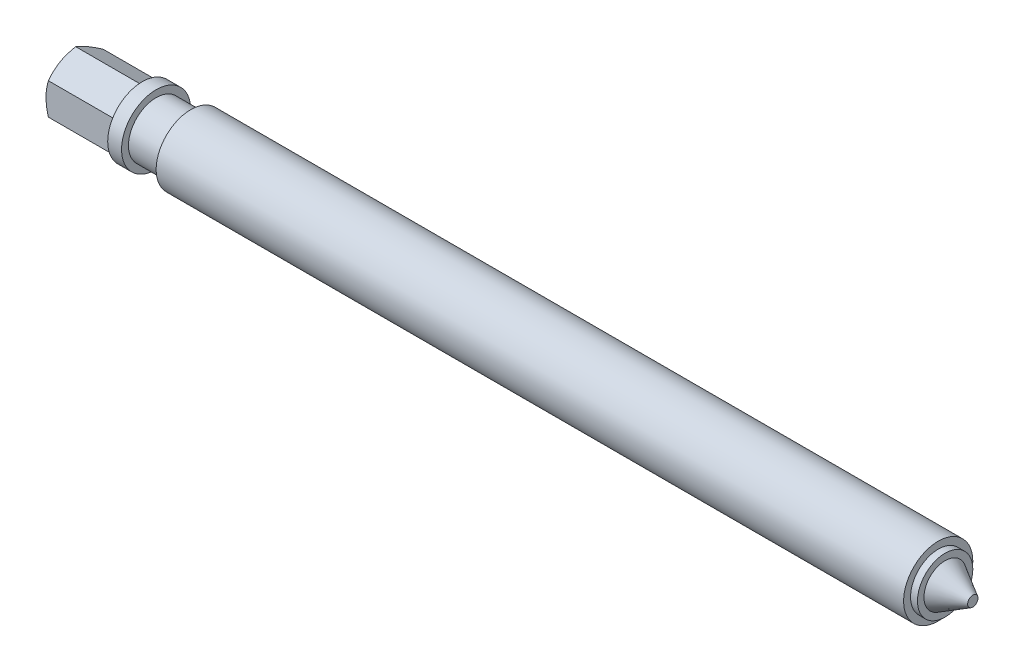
ISO-10303-21;
HEADER;
FILE_DESCRIPTION(('STEP AP214'),'2;1');
FILE_NAME('part.step','',(''),(''),'','','');
FILE_SCHEMA(('AUTOMOTIVE_DESIGN { 1 0 10303 214 1 1 1 1 }'));
ENDSEC;
DATA;
#1=APPLICATION_CONTEXT('core data for automotive mechanical design processes');
#2=APPLICATION_PROTOCOL_DEFINITION('international standard','automotive_design',2000,#1);
#3=PRODUCT_CONTEXT('',#1,'mechanical');
#4=PRODUCT('Part','Part','',(#3));
#5=PRODUCT_RELATED_PRODUCT_CATEGORY('part','',(#4));
#6=PRODUCT_DEFINITION_FORMATION('','',#4);
#7=PRODUCT_DEFINITION_CONTEXT('part definition',#1,'design');
#8=PRODUCT_DEFINITION('design','',#6,#7);
#9=PRODUCT_DEFINITION_SHAPE('','',#8);
#10=(LENGTH_UNIT() NAMED_UNIT(*) SI_UNIT(.MILLI.,.METRE.));
#11=(NAMED_UNIT(*) PLANE_ANGLE_UNIT() SI_UNIT($,.RADIAN.));
#12=(NAMED_UNIT(*) SI_UNIT($,.STERADIAN.) SOLID_ANGLE_UNIT());
#13=UNCERTAINTY_MEASURE_WITH_UNIT(LENGTH_MEASURE(1.E-05),#10,'distance_accuracy_value','');
#14=(GEOMETRIC_REPRESENTATION_CONTEXT(3) GLOBAL_UNCERTAINTY_ASSIGNED_CONTEXT((#13)) GLOBAL_UNIT_ASSIGNED_CONTEXT((#10,
#11,#12)) REPRESENTATION_CONTEXT('',''));
#15=CARTESIAN_POINT('',(0.,0.,0.));
#16=DIRECTION('',(0.,0.,1.));
#17=DIRECTION('',(1.,0.,0.));
#18=AXIS2_PLACEMENT_3D('',#15,#16,#17);
#19=CARTESIAN_POINT('',(0.,0.,0.));
#20=DIRECTION('',(1.,0.,0.));
#21=DIRECTION('',(0.,0.,-1.));
#22=AXIS2_PLACEMENT_3D('',#19,#20,#21);
#23=CYLINDRICAL_SURFACE('',#22,4.99999999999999);
#24=CARTESIAN_POINT('',(-113.,0.,0.));
#25=DIRECTION('',(1.,0.,0.));
#26=DIRECTION('',(0.,1.,0.));
#27=AXIS2_PLACEMENT_3D('',#24,#25,#26);
#28=CIRCLE('',#27,4.99999999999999);
#29=CARTESIAN_POINT('',(-113.,4.99999999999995,0.));
#30=VERTEX_POINT('',#29);
#31=EDGE_CURVE('E192',#30,#30,#28,.T.);
#32=ORIENTED_EDGE('',*,*,#31,.T.);
#33=EDGE_LOOP('',(#32));
#34=FACE_BOUND('',#33,.T.);
#35=CARTESIAN_POINT('',(-5.,0.,0.));
#36=DIRECTION('',(1.,0.,0.));
#37=DIRECTION('',(0.,0.,-1.));
#38=AXIS2_PLACEMENT_3D('',#35,#36,#37);
#39=CIRCLE('',#38,5.);
#40=CARTESIAN_POINT('',(-5.,0.,-5.));
#41=VERTEX_POINT('',#40);
#42=EDGE_CURVE('E65',#41,#41,#39,.T.);
#43=ORIENTED_EDGE('',*,*,#42,.F.);
#44=EDGE_LOOP('',(#43));
#45=FACE_BOUND('',#44,.T.);
#46=ADVANCED_FACE('F52',(#34,#45),#23,.T.);
#47=CARTESIAN_POINT('',(-5.,4.,0.));
#48=DIRECTION('',(1.,0.,0.));
#49=DIRECTION('',(0.,0.,-1.));
#50=AXIS2_PLACEMENT_3D('',#47,#48,#49);
#51=PLANE('',#50);
#52=ORIENTED_EDGE('',*,*,#42,.T.);
#53=EDGE_LOOP('',(#52));
#54=FACE_BOUND('',#53,.T.);
#55=CARTESIAN_POINT('',(-5.,0.,0.));
#56=DIRECTION('',(1.,0.,0.));
#57=DIRECTION('',(0.,0.,-1.));
#58=AXIS2_PLACEMENT_3D('',#55,#56,#57);
#59=CIRCLE('',#58,4.);
#60=CARTESIAN_POINT('',(-5.,0.,-4.));
#61=VERTEX_POINT('',#60);
#62=EDGE_CURVE('E149',#61,#61,#59,.T.);
#63=ORIENTED_EDGE('',*,*,#62,.F.);
#64=EDGE_LOOP('',(#63));
#65=FACE_BOUND('',#64,.T.);
#66=ADVANCED_FACE('F245',(#54,#65),#51,.T.);
#67=CARTESIAN_POINT('',(0.,0.,0.));
#68=DIRECTION('',(1.,0.,0.));
#69=DIRECTION('',(0.,0.,-1.));
#70=AXIS2_PLACEMENT_3D('',#67,#68,#69);
#71=CYLINDRICAL_SURFACE('',#70,4.);
#72=ORIENTED_EDGE('',*,*,#62,.T.);
#73=EDGE_LOOP('',(#72));
#74=FACE_BOUND('',#73,.T.);
#75=CARTESIAN_POINT('',(-4.,0.,0.));
#76=DIRECTION('',(1.,0.,0.));
#77=DIRECTION('',(0.,0.,-1.));
#78=AXIS2_PLACEMENT_3D('',#75,#76,#77);
#79=CIRCLE('',#78,4.);
#80=CARTESIAN_POINT('',(-4.,0.,-4.));
#81=VERTEX_POINT('',#80);
#82=EDGE_CURVE('E146',#81,#81,#79,.T.);
#83=ORIENTED_EDGE('',*,*,#82,.F.);
#84=EDGE_LOOP('',(#83));
#85=FACE_BOUND('',#84,.T.);
#86=ADVANCED_FACE('F250',(#74,#85),#71,.T.);
#87=CARTESIAN_POINT('',(-4.,3.0594010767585,0.));
#88=DIRECTION('',(1.,0.,0.));
#89=DIRECTION('',(0.,0.,-1.));
#90=AXIS2_PLACEMENT_3D('',#87,#88,#89);
#91=PLANE('',#90);
#92=ORIENTED_EDGE('',*,*,#82,.T.);
#93=EDGE_LOOP('',(#92));
#94=FACE_BOUND('',#93,.T.);
#95=CARTESIAN_POINT('',(-4.,0.,0.));
#96=DIRECTION('',(1.,0.,0.));
#97=DIRECTION('',(0.,0.,-1.));
#98=AXIS2_PLACEMENT_3D('',#95,#96,#97);
#99=CIRCLE('',#98,3.05940107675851);
#100=CARTESIAN_POINT('',(-4.,0.,3.05940107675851));
#101=VERTEX_POINT('',#100);
#102=EDGE_CURVE('E142',#101,#101,#99,.T.);
#103=ORIENTED_EDGE('',*,*,#102,.F.);
#104=EDGE_LOOP('',(#103));
#105=FACE_BOUND('',#104,.T.);
#106=ADVANCED_FACE('F339',(#94,#105),#91,.T.);
#107=CARTESIAN_POINT('',(0.,0.,0.));
#108=DIRECTION('',(-1.,0.,0.));
#109=DIRECTION('',(0.,0.,1.));
#110=AXIS2_PLACEMENT_3D('',#107,#108,#109);
#111=CONICAL_SURFACE('',#110,0.75,0.5235987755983);
#112=CARTESIAN_POINT('',(0.,0.,0.));
#113=DIRECTION('',(1.,0.,0.));
#114=DIRECTION('',(0.,0.,-1.));
#115=AXIS2_PLACEMENT_3D('',#112,#113,#114);
#116=CIRCLE('',#115,0.75);
#117=CARTESIAN_POINT('',(0.,0.,0.75));
#118=VERTEX_POINT('',#117);
#119=EDGE_CURVE('E139',#118,#118,#116,.T.);
#120=CARTESIAN_POINT('',(-4.,0.,3.05940107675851));
#121=CARTESIAN_POINT('',(-3.95833333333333,0.,3.03534481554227));
#122=CARTESIAN_POINT('',(-3.91666666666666,0.,3.01128855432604));
#123=CARTESIAN_POINT('',(-3.83333333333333,0.,2.96317603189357));
#124=CARTESIAN_POINT('',(-3.79166666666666,0.,2.93911977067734));
#125=CARTESIAN_POINT('',(-3.70833333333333,0.,2.89100724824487));
#126=CARTESIAN_POINT('',(-3.66666666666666,0.,2.86695098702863));
#127=CARTESIAN_POINT('',(-3.58333333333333,0.,2.81883846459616));
#128=CARTESIAN_POINT('',(-3.54166666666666,0.,2.79478220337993));
#129=CARTESIAN_POINT('',(-3.45833333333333,0.,2.74666968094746));
#130=CARTESIAN_POINT('',(-3.41666666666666,0.,2.72261341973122));
#131=CARTESIAN_POINT('',(-3.33333333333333,0.,2.67450089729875));
#132=CARTESIAN_POINT('',(-3.29166666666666,0.,2.65044463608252));
#133=CARTESIAN_POINT('',(-3.20833333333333,0.,2.60233211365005));
#134=CARTESIAN_POINT('',(-3.16666666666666,0.,2.57827585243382));
#135=CARTESIAN_POINT('',(-3.08333333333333,0.,2.53016333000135));
#136=CARTESIAN_POINT('',(-3.04166666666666,0.,2.50610706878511));
#137=CARTESIAN_POINT('',(-2.95833333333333,0.,2.45799454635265));
#138=CARTESIAN_POINT('',(-2.91666666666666,0.,2.43393828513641));
#139=CARTESIAN_POINT('',(-2.83333333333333,0.,2.38582576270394));
#140=CARTESIAN_POINT('',(-2.79166666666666,0.,2.36176950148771));
#141=CARTESIAN_POINT('',(-2.70833333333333,0.,2.31365697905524));
#142=CARTESIAN_POINT('',(-2.66666666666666,0.,2.289600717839));
#143=CARTESIAN_POINT('',(-2.58333333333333,0.,2.24148819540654));
#144=CARTESIAN_POINT('',(-2.54166666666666,0.,2.2174319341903));
#145=CARTESIAN_POINT('',(-2.45833333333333,0.,2.16931941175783));
#146=CARTESIAN_POINT('',(-2.41666666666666,0.,2.1452631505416));
#147=CARTESIAN_POINT('',(-2.33333333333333,0.,2.09715062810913));
#148=CARTESIAN_POINT('',(-2.29166666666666,0.,2.07309436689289));
#149=CARTESIAN_POINT('',(-2.20833333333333,0.,2.02498184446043));
#150=CARTESIAN_POINT('',(-2.16666666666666,0.,2.00092558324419));
#151=CARTESIAN_POINT('',(-2.08333333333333,0.,1.95281306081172));
#152=CARTESIAN_POINT('',(-2.04166666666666,0.,1.92875679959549));
#153=CARTESIAN_POINT('',(-1.95833333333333,0.,1.88064427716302));
#154=CARTESIAN_POINT('',(-1.91666666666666,0.,1.85658801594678));
#155=CARTESIAN_POINT('',(-1.83333333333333,0.,1.80847549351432));
#156=CARTESIAN_POINT('',(-1.79166666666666,0.,1.78441923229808));
#157=CARTESIAN_POINT('',(-1.70833333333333,0.,1.73630670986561));
#158=CARTESIAN_POINT('',(-1.66666666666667,0.,1.71225044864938));
#159=CARTESIAN_POINT('',(-1.58333333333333,0.,1.66413792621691));
#160=CARTESIAN_POINT('',(-1.54166666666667,0.,1.64008166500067));
#161=CARTESIAN_POINT('',(-1.45833333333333,0.,1.59196914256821));
#162=CARTESIAN_POINT('',(-1.41666666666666,0.,1.56791288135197));
#163=CARTESIAN_POINT('',(-1.33333333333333,0.,1.5198003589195));
#164=CARTESIAN_POINT('',(-1.29166666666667,0.,1.49574409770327));
#165=CARTESIAN_POINT('',(-1.20833333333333,0.,1.4476315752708));
#166=CARTESIAN_POINT('',(-1.16666666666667,0.,1.42357531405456));
#167=CARTESIAN_POINT('',(-1.08333333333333,0.,1.3754627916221));
#168=CARTESIAN_POINT('',(-1.04166666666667,0.,1.35140653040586));
#169=CARTESIAN_POINT('',(-0.958333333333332,0.,1.30329400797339));
#170=CARTESIAN_POINT('',(-0.916666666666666,0.,1.27923774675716));
#171=CARTESIAN_POINT('',(-0.833333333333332,0.,1.23112522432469));
#172=CARTESIAN_POINT('',(-0.791666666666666,0.,1.20706896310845));
#173=CARTESIAN_POINT('',(-0.708333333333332,0.,1.15895644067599));
#174=CARTESIAN_POINT('',(-0.666666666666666,0.,1.13490017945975));
#175=CARTESIAN_POINT('',(-0.583333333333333,0.,1.08678765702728));
#176=CARTESIAN_POINT('',(-0.541666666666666,0.,1.06273139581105));
#177=CARTESIAN_POINT('',(-0.458333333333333,0.,1.01461887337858));
#178=CARTESIAN_POINT('',(-0.416666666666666,0.,0.990562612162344));
#179=CARTESIAN_POINT('',(-0.333333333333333,0.,0.942450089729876));
#180=CARTESIAN_POINT('',(-0.291666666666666,0.,0.918393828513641));
#181=CARTESIAN_POINT('',(-0.208333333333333,0.,0.870281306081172));
#182=CARTESIAN_POINT('',(-0.166666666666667,0.,0.846225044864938));
#183=CARTESIAN_POINT('',(-0.0833333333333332,0.,0.798112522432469));
#184=CARTESIAN_POINT('',(-0.0416666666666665,0.,0.774056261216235));
#185=CARTESIAN_POINT('',(0.,0.,0.75));
#186=B_SPLINE_CURVE_WITH_KNOTS('',3,(#120,#121,#122,#123,#124,#125,#126,#127,#128,#129,#130,
#131,#132,#133,#134,#135,#136,#137,#138,#139,#140,#141,#142,#143,#144,#145,#146,#147,#148,#149,
#150,#151,#152,#153,#154,#155,#156,#157,#158,#159,#160,#161,#162,#163,#164,#165,#166,#167,#168,
#169,#170,#171,#172,#173,#174,#175,#176,#177,#178,#179,#180,#181,#182,#183,#184,#185),
.UNSPECIFIED.,.F.,.F.,(4,2,2,2,2,2,2,2,2,2,2,2,2,2,2,2,2,2,2,2,2,2,2,2,2,2,2,2,2,2,2,2,4),(0.,
0.144337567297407,0.288675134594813,0.433012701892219,0.577350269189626,0.721687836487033,
0.866025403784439,1.01036297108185,1.15470053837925,1.29903810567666,1.44337567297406,
1.58771324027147,1.73205080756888,1.87638837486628,2.02072594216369,2.1650635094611,
2.3094010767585,2.45373864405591,2.59807621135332,2.74241377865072,2.88675134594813,
3.03108891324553,3.17542648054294,3.31976404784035,3.46410161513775,3.60843918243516,
3.75277674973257,3.89711431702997,4.04145188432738,4.18578945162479,4.33012701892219,
4.4744645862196,4.618802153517),.UNSPECIFIED.);
#187=EDGE_CURVE('BSEAM274',#101,#118,#186,.T.);
#188=ORIENTED_EDGE('',*,*,#102,.T.);
#189=ORIENTED_EDGE('',*,*,#119,.F.);
#190=ORIENTED_EDGE('',*,*,#187,.T.);
#191=ORIENTED_EDGE('',*,*,#187,.F.);
#192=EDGE_LOOP('',(#188,#190,#189,#191));
#193=FACE_BOUND('',#192,.T.);
#194=ADVANCED_FACE('F274',(#193),#111,.T.);
#195=CARTESIAN_POINT('',(0.,0.,0.));
#196=DIRECTION('',(1.,0.,0.));
#197=DIRECTION('',(0.,0.,-1.));
#198=AXIS2_PLACEMENT_3D('',#195,#196,#197);
#199=PLANE('',#198);
#200=ORIENTED_EDGE('',*,*,#119,.T.);
#201=EDGE_LOOP('',(#200));
#202=FACE_BOUND('',#201,.T.);
#203=ADVANCED_FACE('F266',(#202),#199,.T.);
#204=CARTESIAN_POINT('',(-118.,4.99999999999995,0.));
#205=DIRECTION('',(-1.,0.,0.));
#206=DIRECTION('',(0.,-1.,0.));
#207=AXIS2_PLACEMENT_3D('',#204,#205,#206);
#208=PLANE('',#207);
#209=CARTESIAN_POINT('',(-118.,0.,0.));
#210=DIRECTION('',(1.,0.,0.));
#211=DIRECTION('',(0.,1.,0.));
#212=AXIS2_PLACEMENT_3D('',#209,#210,#211);
#213=CIRCLE('',#212,3.99999999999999);
#214=CARTESIAN_POINT('',(-118.,3.99999999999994,0.));
#215=VERTEX_POINT('',#214);
#216=EDGE_CURVE('E186',#215,#215,#213,.T.);
#217=ORIENTED_EDGE('',*,*,#216,.F.);
#218=EDGE_LOOP('',(#217));
#219=FACE_BOUND('',#218,.T.);
#220=CARTESIAN_POINT('',(-118.,0.,0.));
#221=DIRECTION('',(1.,0.,0.));
#222=DIRECTION('',(0.,1.,0.));
#223=AXIS2_PLACEMENT_3D('',#220,#221,#222);
#224=CIRCLE('',#223,4.99999999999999);
#225=CARTESIAN_POINT('',(-118.,4.99999999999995,0.));
#226=VERTEX_POINT('',#225);
#227=EDGE_CURVE('E195',#226,#226,#224,.T.);
#228=ORIENTED_EDGE('',*,*,#227,.T.);
#229=EDGE_LOOP('',(#228));
#230=FACE_BOUND('',#229,.T.);
#231=ADVANCED_FACE('F263',(#219,#230),#208,.F.);
#232=CARTESIAN_POINT('',(0.,0.,0.));
#233=DIRECTION('',(1.,0.,0.));
#234=DIRECTION('',(0.,1.,0.));
#235=AXIS2_PLACEMENT_3D('',#232,#233,#234);
#236=CYLINDRICAL_SURFACE('',#235,3.99999999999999);
#237=CARTESIAN_POINT('',(-113.,0.,0.));
#238=DIRECTION('',(1.,0.,0.));
#239=DIRECTION('',(0.,1.,0.));
#240=AXIS2_PLACEMENT_3D('',#237,#238,#239);
#241=CIRCLE('',#240,3.99999999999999);
#242=CARTESIAN_POINT('',(-113.,3.99999999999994,0.));
#243=VERTEX_POINT('',#242);
#244=EDGE_CURVE('E189',#243,#243,#241,.T.);
#245=ORIENTED_EDGE('',*,*,#244,.F.);
#246=EDGE_LOOP('',(#245));
#247=FACE_BOUND('',#246,.T.);
#248=ORIENTED_EDGE('',*,*,#216,.T.);
#249=EDGE_LOOP('',(#248));
#250=FACE_BOUND('',#249,.T.);
#251=ADVANCED_FACE('F265',(#247,#250),#236,.T.);
#252=CARTESIAN_POINT('',(-113.,4.99999999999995,0.));
#253=DIRECTION('',(1.,0.,0.));
#254=DIRECTION('',(0.,1.,0.));
#255=AXIS2_PLACEMENT_3D('',#252,#253,#254);
#256=PLANE('',#255);
#257=ORIENTED_EDGE('',*,*,#31,.F.);
#258=EDGE_LOOP('',(#257));
#259=FACE_BOUND('',#258,.T.);
#260=ORIENTED_EDGE('',*,*,#244,.T.);
#261=EDGE_LOOP('',(#260));
#262=FACE_BOUND('',#261,.T.);
#263=ADVANCED_FACE('F213',(#259,#262),#256,.F.);
#264=CARTESIAN_POINT('',(-120.,-2.28053356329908,3.94999999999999));
#265=DIRECTION('',(0.,0.,1.));
#266=DIRECTION('',(1.,0.,0.));
#267=AXIS2_PLACEMENT_3D('',#264,#265,#266);
#268=PLANE('',#267);
#269=CARTESIAN_POINT('',(-128.082886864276,-6.04430804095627,3.95));
#270=CARTESIAN_POINT('',(-128.166664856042,-5.87091183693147,3.94999999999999));
#271=CARTESIAN_POINT('',(-128.249608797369,-5.6971052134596,3.94999999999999));
#272=CARTESIAN_POINT('',(-128.413351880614,-5.34844919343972,3.94999999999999));
#273=CARTESIAN_POINT('',(-128.494150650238,-5.17359962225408,3.94999999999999));
#274=CARTESIAN_POINT('',(-128.653553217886,-4.82168927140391,3.94999999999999));
#275=CARTESIAN_POINT('',(-128.732141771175,-4.64462156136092,3.94999999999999));
#276=CARTESIAN_POINT('',(-128.885937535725,-4.28902931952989,3.94999999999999));
#277=CARTESIAN_POINT('',(-128.961144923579,-4.11050486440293,3.94999999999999));
#278=CARTESIAN_POINT('',(-129.108164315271,-3.74951759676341,3.94999999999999));
#279=CARTESIAN_POINT('',(-129.179923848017,-3.56703329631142,3.94999999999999));
#280=CARTESIAN_POINT('',(-129.317812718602,-3.19991085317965,3.94999999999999));
#281=CARTESIAN_POINT('',(-129.383941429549,-3.01527247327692,3.94999999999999));
#282=CARTESIAN_POINT('',(-129.508788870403,-2.6439286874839,3.94999999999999));
#283=CARTESIAN_POINT('',(-129.567523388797,-2.4572286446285,3.94999999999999));
#284=CARTESIAN_POINT('',(-129.675672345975,-2.08117457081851,3.94999999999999));
#285=CARTESIAN_POINT('',(-129.725089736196,-1.89182140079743,3.94999999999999));
#286=CARTESIAN_POINT('',(-129.812203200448,-1.51033010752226,3.94999999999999));
#287=CARTESIAN_POINT('',(-129.849895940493,-1.31819120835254,3.94999999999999));
#288=CARTESIAN_POINT('',(-129.911018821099,-0.931601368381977,3.94999999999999));
#289=CARTESIAN_POINT('',(-129.93444894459,-0.737150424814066,3.94999999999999));
#290=CARTESIAN_POINT('',(-129.964973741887,-0.348182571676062,3.95));
#291=CARTESIAN_POINT('',(-129.972171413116,-0.153673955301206,3.95));
#292=CARTESIAN_POINT('',(-129.969850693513,0.235200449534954,3.94999999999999));
#293=CARTESIAN_POINT('',(-129.960336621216,0.429566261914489,3.94999999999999));
#294=CARTESIAN_POINT('',(-129.930477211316,0.761600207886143,3.94999999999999));
#295=CARTESIAN_POINT('',(-129.913993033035,0.899634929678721,3.95));
#296=CARTESIAN_POINT('',(-129.873670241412,1.17463540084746,3.95));
#297=CARTESIAN_POINT('',(-129.849830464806,1.31160097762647,3.95));
#298=CARTESIAN_POINT('',(-129.768529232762,1.72078378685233,3.95));
#299=CARTESIAN_POINT('',(-129.701306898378,1.99107992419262,3.95));
#300=CARTESIAN_POINT('',(-129.585400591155,2.39552919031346,3.95));
#301=CARTESIAN_POINT('',(-129.543663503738,2.53179135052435,3.95));
#302=CARTESIAN_POINT('',(-129.45606792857,2.80289335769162,3.95));
#303=CARTESIAN_POINT('',(-129.41021228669,2.9377341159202,3.95));
#304=CARTESIAN_POINT('',(-129.315333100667,3.2054294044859,3.95));
#305=CARTESIAN_POINT('',(-129.266328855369,3.33829084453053,3.95));
#306=CARTESIAN_POINT('',(-129.165449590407,3.60298362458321,3.95));
#307=CARTESIAN_POINT('',(-129.113573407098,3.73481452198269,3.95));
#308=CARTESIAN_POINT('',(-129.060544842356,3.86616912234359,3.94999999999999));
#309=B_SPLINE_CURVE_WITH_KNOTS('',3,(#269,#270,#271,#272,#273,#274,#275,#276,#277,#278,#279,
#280,#281,#282,#283,#284,#285,#286,#287,#288,#289,#290,#291,#292,#293,#294,#295,#296,#297,#298,
#299,#300,#301,#302,#303,#304,#305,#306,#307,#308),.UNSPECIFIED.,.F.,.F.,(4,2,2,2,2,2,2,2,2,2,2,
2,2,2,2,2,2,2,2,4),(0.,0.577731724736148,1.15556306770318,1.73670810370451,2.31782275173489,
2.90601071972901,3.49426408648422,4.08123927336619,4.66802820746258,5.2549838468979,
5.84194018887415,6.42516159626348,7.00823231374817,7.42507521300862,7.84198406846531,
8.67642368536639,9.10392261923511,9.53112839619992,9.95592783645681,10.3809006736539),.UNSPECIFIED.);
#310=CARTESIAN_POINT('',(-129.618332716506,-2.28053356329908,3.94999999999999));
#311=VERTEX_POINT('',#310);
#312=CARTESIAN_POINT('',(-129.618332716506,2.28053356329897,3.94999999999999));
#313=VERTEX_POINT('',#312);
#314=EDGE_CURVE('E116',#311,#313,#309,.T.);
#315=ORIENTED_EDGE('',*,*,#314,.F.);
#316=DIRECTION('',(-1.,0.,0.));
#317=VECTOR('',#316,1.);
#318=CARTESIAN_POINT('',(-120.,-2.28053356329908,3.94999999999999));
#319=LINE('',#318,#317);
#320=CARTESIAN_POINT('',(-120.,-2.28053356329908,3.94999999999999));
#321=VERTEX_POINT('',#320);
#322=EDGE_CURVE('E154',#321,#311,#319,.T.);
#323=ORIENTED_EDGE('',*,*,#322,.F.);
#324=DIRECTION('',(0.,1.,0.));
#325=VECTOR('',#324,1.);
#326=CARTESIAN_POINT('',(-120.,-2.28053356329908,3.94999999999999));
#327=LINE('',#326,#325);
#328=CARTESIAN_POINT('',(-120.,2.28053356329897,3.94999999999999));
#329=VERTEX_POINT('',#328);
#330=EDGE_CURVE('E183',#321,#329,#327,.T.);
#331=ORIENTED_EDGE('',*,*,#330,.T.);
#332=DIRECTION('',(-1.,0.,0.));
#333=VECTOR('',#332,1.);
#334=CARTESIAN_POINT('',(-120.,2.28053356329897,3.94999999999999));
#335=LINE('',#334,#333);
#336=EDGE_CURVE('E131',#329,#313,#335,.T.);
#337=ORIENTED_EDGE('',*,*,#336,.T.);
#338=EDGE_LOOP('',(#315,#323,#331,#337));
#339=FACE_BOUND('',#338,.T.);
#340=ADVANCED_FACE('F206',(#339),#268,.T.);
#341=CARTESIAN_POINT('',(-120.,2.28053356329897,3.94999999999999));
#342=DIRECTION('',(0.,0.866025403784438,0.499999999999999));
#343=DIRECTION('',(0.,-0.500000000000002,0.86602540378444));
#344=AXIS2_PLACEMENT_3D('',#341,#342,#343);
#345=PLANE('',#344);
#346=CARTESIAN_POINT('',(-129.618266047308,2.28041809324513,3.95019999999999));
#347=CARTESIAN_POINT('',(-129.676147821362,2.38063568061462,3.77661804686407));
#348=CARTESIAN_POINT('',(-129.728789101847,2.4817183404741,3.60153774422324));
#349=CARTESIAN_POINT('',(-129.82067479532,2.68563399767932,3.24834546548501));
#350=CARTESIAN_POINT('',(-129.85988670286,2.78847061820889,3.07022721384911));
#351=CARTESIAN_POINT('',(-129.920925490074,2.99286939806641,2.7161981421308));
#352=CARTESIAN_POINT('',(-129.943158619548,3.09440010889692,2.54034179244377));
#353=CARTESIAN_POINT('',(-129.969699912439,3.29793924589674,2.18780166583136));
#354=CARTESIAN_POINT('',(-129.974030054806,3.39994693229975,2.01111917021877));
#355=CARTESIAN_POINT('',(-129.965019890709,3.59055257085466,1.68098052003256));
#356=CARTESIAN_POINT('',(-129.953891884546,3.67917906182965,1.52747493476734));
#357=CARTESIAN_POINT('',(-129.918623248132,3.85585464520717,1.22146384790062));
#358=CARTESIAN_POINT('',(-129.894470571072,3.9439031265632,1.06895940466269));
#359=CARTESIAN_POINT('',(-129.834090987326,4.12094295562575,0.762317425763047));
#360=CARTESIAN_POINT('',(-129.797608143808,4.20991189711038,0.60821869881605));
#361=CARTESIAN_POINT('',(-129.714806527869,4.38652285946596,0.302319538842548));
#362=CARTESIAN_POINT('',(-129.668507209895,4.47416714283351,0.150515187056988));
#363=CARTESIAN_POINT('',(-129.618266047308,4.56118259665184,-0.000200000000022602));
#364=B_SPLINE_CURVE_WITH_KNOTS('',3,(#346,#347,#348,#349,#350,#351,#352,#353,#354,#355,#356,
#357,#358,#359,#360,#361,#362,#363),.UNSPECIFIED.,.F.,.F.,(4,2,2,2,2,2,2,2,4),(0.,
0.626122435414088,1.25374984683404,1.86584388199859,2.47718624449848,3.00948555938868,
3.54227805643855,4.08688849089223,4.63042953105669),.UNSPECIFIED.);
#365=CARTESIAN_POINT('',(-129.618332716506,4.561067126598,0.));
#366=VERTEX_POINT('',#365);
#367=EDGE_CURVE('E109',#313,#366,#364,.T.);
#368=ORIENTED_EDGE('',*,*,#367,.F.);
#369=ORIENTED_EDGE('',*,*,#336,.F.);
#370=DIRECTION('',(0.,0.500000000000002,-0.86602540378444));
#371=VECTOR('',#370,1.);
#372=CARTESIAN_POINT('',(-120.,2.28053356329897,3.94999999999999));
#373=LINE('',#372,#371);
#374=CARTESIAN_POINT('',(-120.,4.561067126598,0.));
#375=VERTEX_POINT('',#374);
#376=EDGE_CURVE('E130',#329,#375,#373,.T.);
#377=ORIENTED_EDGE('',*,*,#376,.T.);
#378=DIRECTION('',(-1.,0.,0.));
#379=VECTOR('',#378,1.);
#380=CARTESIAN_POINT('',(-120.,4.561067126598,0.));
#381=LINE('',#380,#379);
#382=EDGE_CURVE('E124',#375,#366,#381,.T.);
#383=ORIENTED_EDGE('',*,*,#382,.T.);
#384=EDGE_LOOP('',(#368,#369,#377,#383));
#385=FACE_BOUND('',#384,.T.);
#386=ADVANCED_FACE('F129',(#385),#345,.T.);
#387=CARTESIAN_POINT('',(-120.,4.561067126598,0.));
#388=DIRECTION('',(0.,0.86602540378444,-0.500000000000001));
#389=DIRECTION('',(0.,0.499999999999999,0.866025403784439));
#390=AXIS2_PLACEMENT_3D('',#387,#388,#389);
#391=PLANE('',#390);
#392=CARTESIAN_POINT('',(-129.618266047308,4.56118259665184,0.000199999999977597));
#393=CARTESIAN_POINT('',(-129.676147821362,4.46096500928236,-0.173381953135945));
#394=CARTESIAN_POINT('',(-129.728789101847,4.35988234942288,-0.348462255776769));
#395=CARTESIAN_POINT('',(-129.82067479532,4.15596669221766,-0.701654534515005));
#396=CARTESIAN_POINT('',(-129.85988670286,4.05313007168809,-0.879772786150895));
#397=CARTESIAN_POINT('',(-129.920925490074,3.84873129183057,-1.23380185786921));
#398=CARTESIAN_POINT('',(-129.943158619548,3.74720058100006,-1.40965820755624));
#399=CARTESIAN_POINT('',(-129.969699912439,3.54366144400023,-1.76219833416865));
#400=CARTESIAN_POINT('',(-129.974030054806,3.44165375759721,-1.93888082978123));
#401=CARTESIAN_POINT('',(-129.965019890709,3.2510481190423,-2.26901947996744));
#402=CARTESIAN_POINT('',(-129.953891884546,3.16242162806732,-2.42252506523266));
#403=CARTESIAN_POINT('',(-129.918623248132,2.98574604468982,-2.72853615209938));
#404=CARTESIAN_POINT('',(-129.894470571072,2.89769756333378,-2.88104059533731));
#405=CARTESIAN_POINT('',(-129.834090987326,2.72065773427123,-3.18768257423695));
#406=CARTESIAN_POINT('',(-129.797608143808,2.63168879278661,-3.34178130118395));
#407=CARTESIAN_POINT('',(-129.714806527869,2.45507783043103,-3.64768046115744));
#408=CARTESIAN_POINT('',(-129.668507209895,2.36743354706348,-3.799484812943));
#409=CARTESIAN_POINT('',(-129.618266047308,2.28041809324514,-3.95020000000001));
#410=B_SPLINE_CURVE_WITH_KNOTS('',3,(#392,#393,#394,#395,#396,#397,#398,#399,#400,#401,#402,
#403,#404,#405,#406,#407,#408,#409),.UNSPECIFIED.,.F.,.F.,(4,2,2,2,2,2,2,2,4),(0.,
0.62612243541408,1.25374984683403,1.86584388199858,2.47718624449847,3.00948555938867,
3.54227805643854,4.08688849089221,4.63042953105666),.UNSPECIFIED.);
#411=CARTESIAN_POINT('',(-129.618332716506,2.28053356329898,-3.95000000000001));
#412=VERTEX_POINT('',#411);
#413=EDGE_CURVE('E113',#366,#412,#410,.T.);
#414=ORIENTED_EDGE('',*,*,#413,.F.);
#415=ORIENTED_EDGE('',*,*,#382,.F.);
#416=DIRECTION('',(0.,-0.499999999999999,-0.866025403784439));
#417=VECTOR('',#416,1.);
#418=CARTESIAN_POINT('',(-120.,4.561067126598,0.));
#419=LINE('',#418,#417);
#420=CARTESIAN_POINT('',(-120.,2.28053356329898,-3.95000000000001));
#421=VERTEX_POINT('',#420);
#422=EDGE_CURVE('E79',#375,#421,#419,.T.);
#423=ORIENTED_EDGE('',*,*,#422,.T.);
#424=DIRECTION('',(-1.,0.,0.));
#425=VECTOR('',#424,1.);
#426=CARTESIAN_POINT('',(-120.,2.28053356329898,-3.95000000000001));
#427=LINE('',#426,#425);
#428=EDGE_CURVE('E126',#421,#412,#427,.T.);
#429=ORIENTED_EDGE('',*,*,#428,.T.);
#430=EDGE_LOOP('',(#414,#415,#423,#429));
#431=FACE_BOUND('',#430,.T.);
#432=ADVANCED_FACE('F123',(#431),#391,.T.);
#433=CARTESIAN_POINT('',(-120.,2.28053356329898,-3.95000000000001));
#434=DIRECTION('',(0.,0.,-1.));
#435=DIRECTION('',(0.,1.,0.));
#436=AXIS2_PLACEMENT_3D('',#433,#434,#435);
#437=PLANE('',#436);
#438=CARTESIAN_POINT('',(-128.082886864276,-6.04430804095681,-3.95));
#439=CARTESIAN_POINT('',(-128.166664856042,-5.87091183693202,-3.95000000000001));
#440=CARTESIAN_POINT('',(-128.249608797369,-5.69710521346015,-3.95000000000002));
#441=CARTESIAN_POINT('',(-128.413351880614,-5.34844919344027,-3.95000000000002));
#442=CARTESIAN_POINT('',(-128.494150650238,-5.17359962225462,-3.95000000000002));
#443=CARTESIAN_POINT('',(-128.653553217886,-4.82168927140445,-3.95000000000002));
#444=CARTESIAN_POINT('',(-128.732141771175,-4.64462156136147,-3.95000000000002));
#445=CARTESIAN_POINT('',(-128.885937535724,-4.28902931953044,-3.95000000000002));
#446=CARTESIAN_POINT('',(-128.961144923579,-4.11050486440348,-3.95000000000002));
#447=CARTESIAN_POINT('',(-129.108164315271,-3.74951759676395,-3.95000000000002));
#448=CARTESIAN_POINT('',(-129.179923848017,-3.56703329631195,-3.95000000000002));
#449=CARTESIAN_POINT('',(-129.317812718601,-3.19991085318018,-3.95000000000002));
#450=CARTESIAN_POINT('',(-129.383941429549,-3.01527247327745,-3.95000000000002));
#451=CARTESIAN_POINT('',(-129.508788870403,-2.64392868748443,-3.95000000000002));
#452=CARTESIAN_POINT('',(-129.567523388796,-2.45722864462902,-3.95000000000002));
#453=CARTESIAN_POINT('',(-129.675672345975,-2.08117457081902,-3.95000000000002));
#454=CARTESIAN_POINT('',(-129.725089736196,-1.89182140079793,-3.95000000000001));
#455=CARTESIAN_POINT('',(-129.812203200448,-1.51033010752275,-3.95000000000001));
#456=CARTESIAN_POINT('',(-129.849895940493,-1.31819120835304,-3.95000000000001));
#457=CARTESIAN_POINT('',(-129.911018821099,-0.931601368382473,-3.95000000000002));
#458=CARTESIAN_POINT('',(-129.93444894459,-0.737150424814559,-3.95000000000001));
#459=CARTESIAN_POINT('',(-129.964973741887,-0.348182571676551,-3.95000000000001));
#460=CARTESIAN_POINT('',(-129.972171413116,-0.153673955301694,-3.95000000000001));
#461=CARTESIAN_POINT('',(-129.969850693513,0.235200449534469,-3.95000000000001));
#462=CARTESIAN_POINT('',(-129.960336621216,0.429566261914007,-3.95000000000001));
#463=CARTESIAN_POINT('',(-129.930477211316,0.761600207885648,-3.95000000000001));
#464=CARTESIAN_POINT('',(-129.913993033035,0.899634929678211,-3.95000000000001));
#465=CARTESIAN_POINT('',(-129.873670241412,1.17463540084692,-3.95000000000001));
#466=CARTESIAN_POINT('',(-129.849830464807,1.31160097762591,-3.95000000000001));
#467=CARTESIAN_POINT('',(-129.768529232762,1.72078378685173,-3.95000000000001));
#468=CARTESIAN_POINT('',(-129.701306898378,1.99107992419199,-3.95000000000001));
#469=CARTESIAN_POINT('',(-129.585400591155,2.39552919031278,-3.95000000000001));
#470=CARTESIAN_POINT('',(-129.543663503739,2.53179135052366,-3.95000000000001));
#471=CARTESIAN_POINT('',(-129.45606792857,2.80289335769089,-3.95000000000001));
#472=CARTESIAN_POINT('',(-129.41021228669,2.93773411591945,-3.95000000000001));
#473=CARTESIAN_POINT('',(-129.315333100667,3.20542940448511,-3.95000000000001));
#474=CARTESIAN_POINT('',(-129.26632885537,3.33829084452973,-3.95000000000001));
#475=CARTESIAN_POINT('',(-129.165449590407,3.60298362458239,-3.95000000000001));
#476=CARTESIAN_POINT('',(-129.113573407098,3.73481452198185,-3.95000000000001));
#477=CARTESIAN_POINT('',(-129.060544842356,3.86616912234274,-3.95000000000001));
#478=B_SPLINE_CURVE_WITH_KNOTS('',3,(#438,#439,#440,#441,#442,#443,#444,#445,#446,#447,#448,
#449,#450,#451,#452,#453,#454,#455,#456,#457,#458,#459,#460,#461,#462,#463,#464,#465,#466,#467,
#468,#469,#470,#471,#472,#473,#474,#475,#476,#477),.UNSPECIFIED.,.F.,.F.,(4,2,2,2,2,2,2,2,2,2,2,
2,2,2,2,2,2,2,2,4),(0.,0.57773172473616,1.15556306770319,1.73670810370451,2.3178227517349,
2.90601071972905,3.49426408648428,4.08123927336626,4.66802820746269,5.25498384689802,
5.84194018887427,6.42516159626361,7.0082323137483,7.42507521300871,7.84198406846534,
8.67642368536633,9.10392261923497,9.53112839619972,9.95592783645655,10.3809006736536),.UNSPECIFIED.);
#479=CARTESIAN_POINT('',(-129.618332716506,-2.28053356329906,-3.95000000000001));
#480=VERTEX_POINT('',#479);
#481=EDGE_CURVE('E127',#412,#480,#478,.F.);
#482=ORIENTED_EDGE('',*,*,#481,.F.);
#483=ORIENTED_EDGE('',*,*,#428,.F.);
#484=DIRECTION('',(0.,-1.,0.));
#485=VECTOR('',#484,1.);
#486=CARTESIAN_POINT('',(-120.,2.28053356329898,-3.95000000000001));
#487=LINE('',#486,#485);
#488=CARTESIAN_POINT('',(-120.,-2.28053356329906,-3.95000000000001));
#489=VERTEX_POINT('',#488);
#490=EDGE_CURVE('E170',#421,#489,#487,.T.);
#491=ORIENTED_EDGE('',*,*,#490,.T.);
#492=DIRECTION('',(-1.,0.,0.));
#493=VECTOR('',#492,1.);
#494=CARTESIAN_POINT('',(-120.,-2.28053356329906,-3.95000000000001));
#495=LINE('',#494,#493);
#496=EDGE_CURVE('E133',#489,#480,#495,.T.);
#497=ORIENTED_EDGE('',*,*,#496,.T.);
#498=EDGE_LOOP('',(#482,#483,#491,#497));
#499=FACE_BOUND('',#498,.T.);
#500=ADVANCED_FACE('F169',(#499),#437,.T.);
#501=CARTESIAN_POINT('',(-120.,-2.28053356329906,-3.95000000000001));
#502=DIRECTION('',(0.,-0.866025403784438,-0.499999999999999));
#503=DIRECTION('',(0.,0.500000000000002,-0.86602540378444));
#504=AXIS2_PLACEMENT_3D('',#501,#502,#503);
#505=PLANE('',#504);
#506=CARTESIAN_POINT('',(-129.618266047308,-2.28041809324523,-3.95020000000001));
#507=CARTESIAN_POINT('',(-129.676147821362,-2.38063568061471,-3.77661804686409));
#508=CARTESIAN_POINT('',(-129.728789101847,-2.48171834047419,-3.60153774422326));
#509=CARTESIAN_POINT('',(-129.82067479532,-2.68563399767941,-3.24834546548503));
#510=CARTESIAN_POINT('',(-129.85988670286,-2.78847061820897,-3.07022721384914));
#511=CARTESIAN_POINT('',(-129.920925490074,-2.99286939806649,-2.71619814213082));
#512=CARTESIAN_POINT('',(-129.943158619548,-3.094400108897,-2.5403417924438));
#513=CARTESIAN_POINT('',(-129.969699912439,-3.29793924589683,-2.18780166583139));
#514=CARTESIAN_POINT('',(-129.974030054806,-3.39994693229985,-2.01111917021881));
#515=CARTESIAN_POINT('',(-129.965019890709,-3.59055257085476,-1.6809805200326));
#516=CARTESIAN_POINT('',(-129.953891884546,-3.67917906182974,-1.52747493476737));
#517=CARTESIAN_POINT('',(-129.918623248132,-3.85585464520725,-1.22146384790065));
#518=CARTESIAN_POINT('',(-129.894470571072,-3.94390312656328,-1.06895940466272));
#519=CARTESIAN_POINT('',(-129.834090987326,-4.12094295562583,-0.762317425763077));
#520=CARTESIAN_POINT('',(-129.797608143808,-4.20991189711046,-0.608218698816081));
#521=CARTESIAN_POINT('',(-129.714806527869,-4.38652285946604,-0.30231953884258));
#522=CARTESIAN_POINT('',(-129.668507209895,-4.47416714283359,-0.150515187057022));
#523=CARTESIAN_POINT('',(-129.618266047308,-4.56118259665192,0.000199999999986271));
#524=B_SPLINE_CURVE_WITH_KNOTS('',3,(#506,#507,#508,#509,#510,#511,#512,#513,#514,#515,#516,
#517,#518,#519,#520,#521,#522,#523),.UNSPECIFIED.,.F.,.F.,(4,2,2,2,2,2,2,2,4),(0.,
0.626122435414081,1.25374984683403,1.86584388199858,2.47718624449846,3.00948555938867,
3.54227805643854,4.08688849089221,4.63042953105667),.UNSPECIFIED.);
#525=CARTESIAN_POINT('',(-129.618332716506,-4.56106712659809,0.));
#526=VERTEX_POINT('',#525);
#527=EDGE_CURVE('E71',#480,#526,#524,.T.);
#528=ORIENTED_EDGE('',*,*,#527,.F.);
#529=ORIENTED_EDGE('',*,*,#496,.F.);
#530=DIRECTION('',(0.,-0.500000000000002,0.86602540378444));
#531=VECTOR('',#530,1.);
#532=CARTESIAN_POINT('',(-120.,-2.28053356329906,-3.95000000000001));
#533=LINE('',#532,#531);
#534=CARTESIAN_POINT('',(-120.,-4.56106712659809,0.));
#535=VERTEX_POINT('',#534);
#536=EDGE_CURVE('E175',#489,#535,#533,.T.);
#537=ORIENTED_EDGE('',*,*,#536,.T.);
#538=DIRECTION('',(-1.,0.,0.));
#539=VECTOR('',#538,1.);
#540=CARTESIAN_POINT('',(-120.,-4.56106712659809,0.));
#541=LINE('',#540,#539);
#542=EDGE_CURVE('E158',#535,#526,#541,.T.);
#543=ORIENTED_EDGE('',*,*,#542,.T.);
#544=EDGE_LOOP('',(#528,#529,#537,#543));
#545=FACE_BOUND('',#544,.T.);
#546=ADVANCED_FACE('F174',(#545),#505,.T.);
#547=CARTESIAN_POINT('',(-120.,-4.56106712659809,0.));
#548=DIRECTION('',(0.,-0.86602540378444,0.500000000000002));
#549=DIRECTION('',(0.,-0.499999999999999,-0.866025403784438));
#550=AXIS2_PLACEMENT_3D('',#547,#548,#549);
#551=PLANE('',#550);
#552=CARTESIAN_POINT('',(-129.618266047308,-4.56118259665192,-0.000200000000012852));
#553=CARTESIAN_POINT('',(-129.676147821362,-4.46096500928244,0.173381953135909));
#554=CARTESIAN_POINT('',(-129.728789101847,-4.35988234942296,0.348462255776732));
#555=CARTESIAN_POINT('',(-129.82067479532,-4.15596669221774,0.701654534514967));
#556=CARTESIAN_POINT('',(-129.85988670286,-4.05313007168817,0.879772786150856));
#557=CARTESIAN_POINT('',(-129.920925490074,-3.84873129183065,1.23380185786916));
#558=CARTESIAN_POINT('',(-129.943158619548,-3.74720058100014,1.40965820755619));
#559=CARTESIAN_POINT('',(-129.969699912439,-3.54366144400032,1.76219833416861));
#560=CARTESIAN_POINT('',(-129.974030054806,-3.44165375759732,1.93888082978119));
#561=CARTESIAN_POINT('',(-129.965019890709,-3.2510481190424,2.2690194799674));
#562=CARTESIAN_POINT('',(-129.953891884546,-3.16242162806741,2.42252506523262));
#563=CARTESIAN_POINT('',(-129.918623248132,-2.98574604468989,2.72853615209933));
#564=CARTESIAN_POINT('',(-129.894470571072,-2.89769756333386,2.88104059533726));
#565=CARTESIAN_POINT('',(-129.834090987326,-2.72065773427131,3.18768257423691));
#566=CARTESIAN_POINT('',(-129.797608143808,-2.63168879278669,3.34178130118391));
#567=CARTESIAN_POINT('',(-129.714806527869,-2.45507783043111,3.64768046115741));
#568=CARTESIAN_POINT('',(-129.668507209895,-2.36743354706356,3.79948481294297));
#569=CARTESIAN_POINT('',(-129.618266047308,-2.28041809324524,3.95019999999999));
#570=B_SPLINE_CURVE_WITH_KNOTS('',3,(#552,#553,#554,#555,#556,#557,#558,#559,#560,#561,#562,
#563,#564,#565,#566,#567,#568,#569),.UNSPECIFIED.,.F.,.F.,(4,2,2,2,2,2,2,2,4),(0.,
0.626122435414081,1.25374984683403,1.86584388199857,2.47718624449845,3.00948555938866,
3.54227805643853,4.08688849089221,4.63042953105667),.UNSPECIFIED.);
#571=EDGE_CURVE('E14',#526,#311,#570,.T.);
#572=ORIENTED_EDGE('',*,*,#571,.F.);
#573=ORIENTED_EDGE('',*,*,#542,.F.);
#574=DIRECTION('',(0.,0.499999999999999,0.866025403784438));
#575=VECTOR('',#574,1.);
#576=CARTESIAN_POINT('',(-120.,-4.56106712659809,0.));
#577=LINE('',#576,#575);
#578=EDGE_CURVE('E135',#535,#321,#577,.T.);
#579=ORIENTED_EDGE('',*,*,#578,.T.);
#580=ORIENTED_EDGE('',*,*,#322,.T.);
#581=EDGE_LOOP('',(#572,#573,#579,#580));
#582=FACE_BOUND('',#581,.T.);
#583=ADVANCED_FACE('F259',(#582),#551,.T.);
#584=CARTESIAN_POINT('',(-120.,0.,0.));
#585=DIRECTION('',(-1.,0.,0.));
#586=DIRECTION('',(0.,0.,1.));
#587=AXIS2_PLACEMENT_3D('',#584,#585,#586);
#588=PLANE('',#587);
#589=CARTESIAN_POINT('',(-120.,0.,0.));
#590=DIRECTION('',(-1.,0.,0.));
#591=DIRECTION('',(0.,0.,1.));
#592=AXIS2_PLACEMENT_3D('',#589,#590,#591);
#593=CIRCLE('',#592,4.99999999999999);
#594=CARTESIAN_POINT('',(-120.,0.,4.99999999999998));
#595=VERTEX_POINT('',#594);
#596=EDGE_CURVE('E143',#595,#595,#593,.F.);
#597=ORIENTED_EDGE('',*,*,#596,.F.);
#598=EDGE_LOOP('',(#597));
#599=FACE_BOUND('',#598,.T.);
#600=ORIENTED_EDGE('',*,*,#578,.F.);
#601=ORIENTED_EDGE('',*,*,#536,.F.);
#602=ORIENTED_EDGE('',*,*,#490,.F.);
#603=ORIENTED_EDGE('',*,*,#422,.F.);
#604=ORIENTED_EDGE('',*,*,#376,.F.);
#605=ORIENTED_EDGE('',*,*,#330,.F.);
#606=EDGE_LOOP('',(#600,#601,#602,#603,#604,#605));
#607=FACE_BOUND('',#606,.T.);
#608=ADVANCED_FACE('F177',(#599,#607),#588,.T.);
#609=ORIENTED_EDGE('',*,*,#227,.F.);
#610=EDGE_LOOP('',(#609));
#611=FACE_BOUND('',#610,.T.);
#612=ORIENTED_EDGE('',*,*,#596,.T.);
#613=EDGE_LOOP('',(#612));
#614=FACE_BOUND('',#613,.T.);
#615=ADVANCED_FACE('F212',(#611,#614),#23,.T.);
#616=CARTESIAN_POINT('',(-130.,0.,0.));
#617=DIRECTION('',(1.,0.,0.));
#618=DIRECTION('',(0.,1.,0.));
#619=AXIS2_PLACEMENT_3D('',#616,#617,#618);
#620=CONICAL_SURFACE('',#619,3.89999999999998,1.04719755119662);
#621=ORIENTED_EDGE('',*,*,#314,.T.);
#622=ORIENTED_EDGE('',*,*,#367,.T.);
#623=ORIENTED_EDGE('',*,*,#413,.T.);
#624=ORIENTED_EDGE('',*,*,#481,.T.);
#625=ORIENTED_EDGE('',*,*,#527,.T.);
#626=ORIENTED_EDGE('',*,*,#571,.T.);
#627=EDGE_LOOP('',(#621,#622,#623,#624,#625,#626));
#628=FACE_BOUND('',#627,.T.);
#629=CARTESIAN_POINT('',(-130.,0.,0.));
#630=DIRECTION('',(1.,0.,0.));
#631=DIRECTION('',(0.,1.,0.));
#632=AXIS2_PLACEMENT_3D('',#629,#630,#631);
#633=CIRCLE('',#632,3.89999999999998);
#634=CARTESIAN_POINT('',(-130.,3.89999999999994,0.));
#635=VERTEX_POINT('',#634);
#636=EDGE_CURVE('E398',#635,#635,#633,.T.);
#637=ORIENTED_EDGE('',*,*,#636,.T.);
#638=EDGE_LOOP('',(#637));
#639=FACE_BOUND('',#638,.T.);
#640=ADVANCED_FACE('F111',(#628,#639),#620,.T.);
#641=CARTESIAN_POINT('',(-130.,0.,0.));
#642=DIRECTION('',(-1.,0.,0.));
#643=DIRECTION('',(0.,0.,1.));
#644=AXIS2_PLACEMENT_3D('',#641,#642,#643);
#645=PLANE('',#644);
#646=ORIENTED_EDGE('',*,*,#636,.F.);
#647=EDGE_LOOP('',(#646));
#648=FACE_BOUND('',#647,.T.);
#649=ADVANCED_FACE('F54',(#648),#645,.T.);
#650=CLOSED_SHELL('',(#46,#66,#86,#106,#194,#203,#231,#251,#263,#340,#386,#432,#500,#546,#583,
#608,#615,#640,#649));
#651=MANIFOLD_SOLID_BREP('B2',#650);
#652=ADVANCED_BREP_SHAPE_REPRESENTATION('',(#18,#651),#14);
#653=SHAPE_DEFINITION_REPRESENTATION(#9,#652);
ENDSEC;
END-ISO-10303-21;
